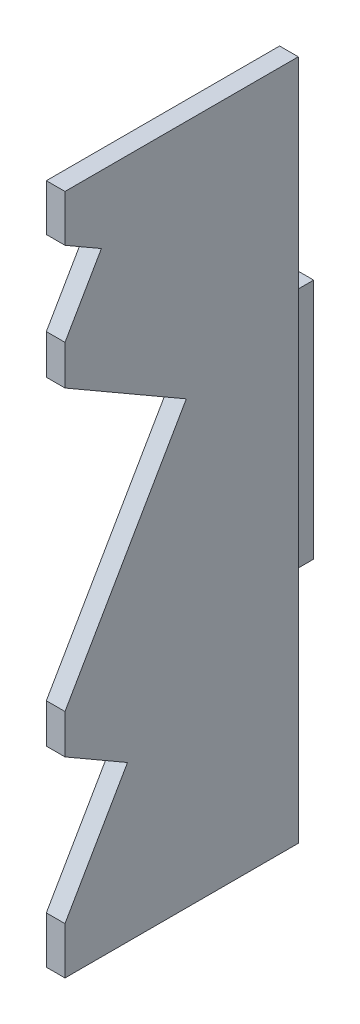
ISO-10303-21;
HEADER;
FILE_DESCRIPTION(('STEP AP214'),'2;1');
FILE_NAME('part.step','',(''),(''),'','','');
FILE_SCHEMA(('AUTOMOTIVE_DESIGN { 1 0 10303 214 1 1 1 1 }'));
ENDSEC;
DATA;
#1=APPLICATION_CONTEXT('core data for automotive mechanical design processes');
#2=APPLICATION_PROTOCOL_DEFINITION('international standard','automotive_design',2000,#1);
#3=PRODUCT_CONTEXT('',#1,'mechanical');
#4=PRODUCT('Part','Part','',(#3));
#5=PRODUCT_RELATED_PRODUCT_CATEGORY('part','',(#4));
#6=PRODUCT_DEFINITION_FORMATION('','',#4);
#7=PRODUCT_DEFINITION_CONTEXT('part definition',#1,'design');
#8=PRODUCT_DEFINITION('design','',#6,#7);
#9=PRODUCT_DEFINITION_SHAPE('','',#8);
#10=(LENGTH_UNIT() NAMED_UNIT(*) SI_UNIT(.MILLI.,.METRE.));
#11=(NAMED_UNIT(*) PLANE_ANGLE_UNIT() SI_UNIT($,.RADIAN.));
#12=(NAMED_UNIT(*) SI_UNIT($,.STERADIAN.) SOLID_ANGLE_UNIT());
#13=UNCERTAINTY_MEASURE_WITH_UNIT(LENGTH_MEASURE(1.E-05),#10,'distance_accuracy_value','');
#14=(GEOMETRIC_REPRESENTATION_CONTEXT(3) GLOBAL_UNCERTAINTY_ASSIGNED_CONTEXT((#13)) GLOBAL_UNIT_ASSIGNED_CONTEXT((#10,
#11,#12)) REPRESENTATION_CONTEXT('',''));
#15=CARTESIAN_POINT('',(0.,0.,0.));
#16=DIRECTION('',(0.,0.,1.));
#17=DIRECTION('',(1.,0.,0.));
#18=AXIS2_PLACEMENT_3D('',#15,#16,#17);
#19=CARTESIAN_POINT('',(0.,41.3691688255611,12.5285300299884));
#20=DIRECTION('',(-1.,0.,0.));
#21=DIRECTION('',(0.,1.,0.));
#22=AXIS2_PLACEMENT_3D('',#19,#20,#21);
#23=PLANE('',#22);
#24=DIRECTION('',(0.,1.,0.));
#25=VECTOR('',#24,1.);
#26=CARTESIAN_POINT('',(0.,35.,7.69999999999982));
#27=LINE('',#26,#25);
#28=CARTESIAN_POINT('',(0.,-35.,7.69999999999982));
#29=VERTEX_POINT('',#28);
#30=CARTESIAN_POINT('',(0.,35.,7.69999999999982));
#31=VERTEX_POINT('',#30);
#32=EDGE_CURVE('E174',#29,#31,#27,.T.);
#33=ORIENTED_EDGE('',*,*,#32,.F.);
#34=DIRECTION('',(0.,0.,1.));
#35=VECTOR('',#34,1.);
#36=CARTESIAN_POINT('',(0.,-35.,7.69999999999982));
#37=LINE('',#36,#35);
#38=CARTESIAN_POINT('',(0.,-34.9999999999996,0.));
#39=VERTEX_POINT('',#38);
#40=EDGE_CURVE('E189',#39,#29,#37,.T.);
#41=ORIENTED_EDGE('',*,*,#40,.F.);
#42=DIRECTION('',(0.,-1.,0.));
#43=VECTOR('',#42,1.);
#44=CARTESIAN_POINT('',(0.,73.,0.));
#45=LINE('',#44,#43);
#46=CARTESIAN_POINT('',(0.,-73.,0.));
#47=VERTEX_POINT('',#46);
#48=EDGE_CURVE('E220',#39,#47,#45,.T.);
#49=ORIENTED_EDGE('',*,*,#48,.T.);
#50=DIRECTION('',(0.,0.,1.));
#51=VECTOR('',#50,1.);
#52=CARTESIAN_POINT('',(0.,-73.,0.));
#53=LINE('',#52,#51);
#54=CARTESIAN_POINT('',(0.,-73.,50.));
#55=VERTEX_POINT('',#54);
#56=EDGE_CURVE('E223',#47,#55,#53,.T.);
#57=ORIENTED_EDGE('',*,*,#56,.T.);
#58=DIRECTION('',(0.,1.,0.));
#59=VECTOR('',#58,1.);
#60=CARTESIAN_POINT('',(0.,-73.,50.));
#61=LINE('',#60,#59);
#62=CARTESIAN_POINT('',(0.,-62.9094808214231,50.));
#63=VERTEX_POINT('',#62);
#64=EDGE_CURVE('E260',#55,#63,#61,.T.);
#65=ORIENTED_EDGE('',*,*,#64,.T.);
#66=DIRECTION('',(0.,0.866025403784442,-0.5));
#67=VECTOR('',#66,1.);
#68=CARTESIAN_POINT('',(0.,-39.6999999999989,36.6));
#69=LINE('',#68,#67);
#70=CARTESIAN_POINT('',(0.,-39.6999999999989,36.6));
#71=VERTEX_POINT('',#70);
#72=EDGE_CURVE('E261',#63,#71,#69,.T.);
#73=ORIENTED_EDGE('',*,*,#72,.T.);
#74=DIRECTION('',(0.,0.499999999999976,0.866025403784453));
#75=VECTOR('',#74,1.);
#76=CARTESIAN_POINT('',(0.,-39.6999999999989,36.6));
#77=LINE('',#76,#75);
#78=CARTESIAN_POINT('',(0.,-31.9635063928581,50.));
#79=VERTEX_POINT('',#78);
#80=EDGE_CURVE('E263',#71,#79,#77,.T.);
#81=ORIENTED_EDGE('',*,*,#80,.T.);
#82=DIRECTION('',(0.,1.,0.));
#83=VECTOR('',#82,1.);
#84=CARTESIAN_POINT('',(0.,-31.9635063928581,50.));
#85=LINE('',#84,#83);
#86=CARTESIAN_POINT('',(0.,-23.5333209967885,50.));
#87=VERTEX_POINT('',#86);
#88=EDGE_CURVE('E268',#79,#87,#85,.T.);
#89=ORIENTED_EDGE('',*,*,#88,.T.);
#90=DIRECTION('',(0.,0.866025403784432,-0.500000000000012));
#91=VECTOR('',#90,1.);
#92=CARTESIAN_POINT('',(0.,21.5000000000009,24.));
#93=LINE('',#92,#91);
#94=CARTESIAN_POINT('',(0.,21.5000000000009,24.));
#95=VERTEX_POINT('',#94);
#96=EDGE_CURVE('E271',#87,#95,#93,.T.);
#97=ORIENTED_EDGE('',*,*,#96,.T.);
#98=DIRECTION('',(0.,0.499999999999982,0.866025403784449));
#99=VECTOR('',#98,1.);
#100=CARTESIAN_POINT('',(0.,21.5000000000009,24.));
#101=LINE('',#100,#99);
#102=CARTESIAN_POINT('',(0.,36.5111069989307,50.));
#103=VERTEX_POINT('',#102);
#104=EDGE_CURVE('E274',#95,#103,#101,.T.);
#105=ORIENTED_EDGE('',*,*,#104,.T.);
#106=DIRECTION('',(0.,1.,0.));
#107=VECTOR('',#106,1.);
#108=CARTESIAN_POINT('',(0.,36.5111069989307,50.));
#109=LINE('',#108,#107);
#110=CARTESIAN_POINT('',(0.,44.990003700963,50.));
#111=VERTEX_POINT('',#110);
#112=EDGE_CURVE('E277',#103,#111,#109,.T.);
#113=ORIENTED_EDGE('',*,*,#112,.T.);
#114=DIRECTION('',(0.,0.866025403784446,-0.499999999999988));
#115=VECTOR('',#114,1.);
#116=CARTESIAN_POINT('',(0.,58.5000000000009,42.2));
#117=LINE('',#116,#115);
#118=CARTESIAN_POINT('',(0.,58.5000000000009,42.2));
#119=VERTEX_POINT('',#118);
#120=EDGE_CURVE('E280',#111,#119,#117,.T.);
#121=ORIENTED_EDGE('',*,*,#120,.T.);
#122=DIRECTION('',(0.,0.500000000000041,0.866025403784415));
#123=VECTOR('',#122,1.);
#124=CARTESIAN_POINT('',(0.,58.5000000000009,42.2));
#125=LINE('',#124,#123);
#126=CARTESIAN_POINT('',(0.,63.0033320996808,50.));
#127=VERTEX_POINT('',#126);
#128=EDGE_CURVE('E205',#119,#127,#125,.T.);
#129=ORIENTED_EDGE('',*,*,#128,.T.);
#130=DIRECTION('',(0.,1.,0.));
#131=VECTOR('',#130,1.);
#132=CARTESIAN_POINT('',(0.,63.0033320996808,50.));
#133=LINE('',#132,#131);
#134=CARTESIAN_POINT('',(0.,73.,50.));
#135=VERTEX_POINT('',#134);
#136=EDGE_CURVE('E215',#127,#135,#133,.T.);
#137=ORIENTED_EDGE('',*,*,#136,.T.);
#138=DIRECTION('',(0.,0.,-1.));
#139=VECTOR('',#138,1.);
#140=CARTESIAN_POINT('',(0.,73.,50.));
#141=LINE('',#140,#139);
#142=CARTESIAN_POINT('',(0.,73.,0.));
#143=VERTEX_POINT('',#142);
#144=EDGE_CURVE('E218',#135,#143,#141,.T.);
#145=ORIENTED_EDGE('',*,*,#144,.T.);
#146=CARTESIAN_POINT('',(0.,35.,0.));
#147=VERTEX_POINT('',#146);
#148=EDGE_CURVE('E177',#143,#147,#45,.T.);
#149=ORIENTED_EDGE('',*,*,#148,.T.);
#150=DIRECTION('',(0.,0.,-1.));
#151=VECTOR('',#150,1.);
#152=CARTESIAN_POINT('',(0.,35.,0.));
#153=LINE('',#152,#151);
#154=EDGE_CURVE('E18',#31,#147,#153,.T.);
#155=ORIENTED_EDGE('',*,*,#154,.F.);
#156=EDGE_LOOP('',(#33,#41,#49,#57,#65,#73,#81,#89,#97,#105,#113,#121,#129,#137,#145,#149,#155));
#157=FACE_BOUND('',#156,.T.);
#158=ADVANCED_FACE('F14',(#157),#23,.T.);
#159=CARTESIAN_POINT('',(4.,58.5000000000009,42.2));
#160=DIRECTION('',(0.,0.866025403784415,-0.500000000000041));
#161=DIRECTION('',(0.,-0.500000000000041,-0.866025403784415));
#162=AXIS2_PLACEMENT_3D('',#159,#160,#161);
#163=PLANE('',#162);
#164=ORIENTED_EDGE('',*,*,#128,.F.);
#165=DIRECTION('',(-1.,0.,0.));
#166=VECTOR('',#165,1.);
#167=CARTESIAN_POINT('',(4.,58.5000000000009,42.2));
#168=LINE('',#167,#166);
#169=CARTESIAN_POINT('',(4.,58.5000000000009,42.2));
#170=VERTEX_POINT('',#169);
#171=EDGE_CURVE('E317',#170,#119,#168,.T.);
#172=ORIENTED_EDGE('',*,*,#171,.F.);
#173=DIRECTION('',(0.,0.500000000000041,0.866025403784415));
#174=VECTOR('',#173,1.);
#175=CARTESIAN_POINT('',(4.,58.5000000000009,42.2));
#176=LINE('',#175,#174);
#177=CARTESIAN_POINT('',(4.,63.0033320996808,50.));
#178=VERTEX_POINT('',#177);
#179=EDGE_CURVE('E283',#170,#178,#176,.T.);
#180=ORIENTED_EDGE('',*,*,#179,.T.);
#181=DIRECTION('',(-1.,0.,0.));
#182=VECTOR('',#181,1.);
#183=CARTESIAN_POINT('',(4.,63.0033320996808,50.));
#184=LINE('',#183,#182);
#185=EDGE_CURVE('E9',#178,#127,#184,.T.);
#186=ORIENTED_EDGE('',*,*,#185,.T.);
#187=EDGE_LOOP('',(#164,#172,#180,#186));
#188=FACE_BOUND('',#187,.T.);
#189=ADVANCED_FACE('F16',(#188),#163,.F.);
#190=CARTESIAN_POINT('',(4.,63.0033320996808,50.));
#191=DIRECTION('',(0.,0.,-1.));
#192=DIRECTION('',(0.,-1.,0.));
#193=AXIS2_PLACEMENT_3D('',#190,#191,#192);
#194=PLANE('',#193);
#195=ORIENTED_EDGE('',*,*,#136,.F.);
#196=ORIENTED_EDGE('',*,*,#185,.F.);
#197=DIRECTION('',(0.,1.,0.));
#198=VECTOR('',#197,1.);
#199=CARTESIAN_POINT('',(4.,63.0033320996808,50.));
#200=LINE('',#199,#198);
#201=CARTESIAN_POINT('',(4.,73.,50.));
#202=VERTEX_POINT('',#201);
#203=EDGE_CURVE('E286',#178,#202,#200,.T.);
#204=ORIENTED_EDGE('',*,*,#203,.T.);
#205=DIRECTION('',(-1.,0.,0.));
#206=VECTOR('',#205,1.);
#207=CARTESIAN_POINT('',(4.,73.,50.));
#208=LINE('',#207,#206);
#209=EDGE_CURVE('E24',#202,#135,#208,.T.);
#210=ORIENTED_EDGE('',*,*,#209,.T.);
#211=EDGE_LOOP('',(#195,#196,#204,#210));
#212=FACE_BOUND('',#211,.T.);
#213=ADVANCED_FACE('F338',(#212),#194,.F.);
#214=CARTESIAN_POINT('',(4.,73.,50.));
#215=DIRECTION('',(0.,-1.,0.));
#216=DIRECTION('',(-1.,0.,0.));
#217=AXIS2_PLACEMENT_3D('',#214,#215,#216);
#218=PLANE('',#217);
#219=ORIENTED_EDGE('',*,*,#144,.F.);
#220=ORIENTED_EDGE('',*,*,#209,.F.);
#221=DIRECTION('',(0.,0.,-1.));
#222=VECTOR('',#221,1.);
#223=CARTESIAN_POINT('',(4.,73.,50.));
#224=LINE('',#223,#222);
#225=CARTESIAN_POINT('',(4.,73.,0.));
#226=VERTEX_POINT('',#225);
#227=EDGE_CURVE('E289',#202,#226,#224,.T.);
#228=ORIENTED_EDGE('',*,*,#227,.T.);
#229=DIRECTION('',(-1.,0.,0.));
#230=VECTOR('',#229,1.);
#231=CARTESIAN_POINT('',(4.,73.,0.));
#232=LINE('',#231,#230);
#233=EDGE_CURVE('E254',#226,#143,#232,.T.);
#234=ORIENTED_EDGE('',*,*,#233,.T.);
#235=EDGE_LOOP('',(#219,#220,#228,#234));
#236=FACE_BOUND('',#235,.T.);
#237=ADVANCED_FACE('F341',(#236),#218,.F.);
#238=CARTESIAN_POINT('',(4.,73.,0.));
#239=DIRECTION('',(0.,0.,1.));
#240=DIRECTION('',(1.,0.,0.));
#241=AXIS2_PLACEMENT_3D('',#238,#239,#240);
#242=PLANE('',#241);
#243=ORIENTED_EDGE('',*,*,#148,.F.);
#244=ORIENTED_EDGE('',*,*,#233,.F.);
#245=DIRECTION('',(0.,-1.,0.));
#246=VECTOR('',#245,1.);
#247=CARTESIAN_POINT('',(4.,73.,0.));
#248=LINE('',#247,#246);
#249=CARTESIAN_POINT('',(4.,-73.,0.));
#250=VERTEX_POINT('',#249);
#251=EDGE_CURVE('E251',#226,#250,#248,.T.);
#252=ORIENTED_EDGE('',*,*,#251,.T.);
#253=DIRECTION('',(-1.,0.,0.));
#254=VECTOR('',#253,1.);
#255=CARTESIAN_POINT('',(4.,-73.,0.));
#256=LINE('',#255,#254);
#257=EDGE_CURVE('E249',#250,#47,#256,.T.);
#258=ORIENTED_EDGE('',*,*,#257,.T.);
#259=ORIENTED_EDGE('',*,*,#48,.F.);
#260=DIRECTION('',(1.,0.,0.));
#261=VECTOR('',#260,1.);
#262=CARTESIAN_POINT('',(-6.,-34.9999999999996,0.));
#263=LINE('',#262,#261);
#264=CARTESIAN_POINT('',(-6.,-34.9999999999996,0.));
#265=VERTEX_POINT('',#264);
#266=EDGE_CURVE('E206',#265,#39,#263,.T.);
#267=ORIENTED_EDGE('',*,*,#266,.F.);
#268=DIRECTION('',(0.,-1.,0.));
#269=VECTOR('',#268,1.);
#270=CARTESIAN_POINT('',(-6.,-25.9,0.));
#271=LINE('',#270,#269);
#272=CARTESIAN_POINT('',(-6.,-25.9,0.));
#273=VERTEX_POINT('',#272);
#274=EDGE_CURVE('E200',#273,#265,#271,.T.);
#275=ORIENTED_EDGE('',*,*,#274,.F.);
#276=DIRECTION('',(1.,0.,0.));
#277=VECTOR('',#276,1.);
#278=CARTESIAN_POINT('',(-6.,-25.9,0.));
#279=LINE('',#278,#277);
#280=CARTESIAN_POINT('',(0.,-25.9,0.));
#281=VERTEX_POINT('',#280);
#282=EDGE_CURVE('E209',#273,#281,#279,.T.);
#283=ORIENTED_EDGE('',*,*,#282,.T.);
#284=CARTESIAN_POINT('',(0.,25.9,0.));
#285=VERTEX_POINT('',#284);
#286=EDGE_CURVE('E231',#285,#281,#45,.T.);
#287=ORIENTED_EDGE('',*,*,#286,.F.);
#288=DIRECTION('',(1.,0.,0.));
#289=VECTOR('',#288,1.);
#290=CARTESIAN_POINT('',(-6.,25.9,0.));
#291=LINE('',#290,#289);
#292=CARTESIAN_POINT('',(-6.,25.9,0.));
#293=VERTEX_POINT('',#292);
#294=EDGE_CURVE('E211',#293,#285,#291,.T.);
#295=ORIENTED_EDGE('',*,*,#294,.F.);
#296=DIRECTION('',(0.,-1.,0.));
#297=VECTOR('',#296,1.);
#298=CARTESIAN_POINT('',(-6.,35.,0.));
#299=LINE('',#298,#297);
#300=CARTESIAN_POINT('',(-6.,35.,0.));
#301=VERTEX_POINT('',#300);
#302=EDGE_CURVE('E191',#301,#293,#299,.T.);
#303=ORIENTED_EDGE('',*,*,#302,.F.);
#304=DIRECTION('',(1.,0.,0.));
#305=VECTOR('',#304,1.);
#306=CARTESIAN_POINT('',(-6.,35.,0.));
#307=LINE('',#306,#305);
#308=EDGE_CURVE('E168',#301,#147,#307,.T.);
#309=ORIENTED_EDGE('',*,*,#308,.T.);
#310=EDGE_LOOP('',(#243,#244,#252,#258,#259,#267,#275,#283,#287,#295,#303,#309));
#311=FACE_BOUND('',#310,.T.);
#312=ADVANCED_FACE('F245',(#311),#242,.F.);
#313=CARTESIAN_POINT('',(4.,-73.,0.));
#314=DIRECTION('',(0.,1.,0.));
#315=DIRECTION('',(1.,0.,0.));
#316=AXIS2_PLACEMENT_3D('',#313,#314,#315);
#317=PLANE('',#316);
#318=ORIENTED_EDGE('',*,*,#56,.F.);
#319=ORIENTED_EDGE('',*,*,#257,.F.);
#320=DIRECTION('',(0.,0.,1.));
#321=VECTOR('',#320,1.);
#322=CARTESIAN_POINT('',(4.,-73.,0.));
#323=LINE('',#322,#321);
#324=CARTESIAN_POINT('',(4.,-73.,50.));
#325=VERTEX_POINT('',#324);
#326=EDGE_CURVE('E293',#250,#325,#323,.T.);
#327=ORIENTED_EDGE('',*,*,#326,.T.);
#328=DIRECTION('',(-1.,0.,0.));
#329=VECTOR('',#328,1.);
#330=CARTESIAN_POINT('',(4.,-73.,50.));
#331=LINE('',#330,#329);
#332=EDGE_CURVE('E255',#325,#55,#331,.T.);
#333=ORIENTED_EDGE('',*,*,#332,.T.);
#334=EDGE_LOOP('',(#318,#319,#327,#333));
#335=FACE_BOUND('',#334,.T.);
#336=ADVANCED_FACE('F257',(#335),#317,.F.);
#337=CARTESIAN_POINT('',(4.,-73.,50.));
#338=DIRECTION('',(0.,0.,-1.));
#339=DIRECTION('',(0.,-1.,0.));
#340=AXIS2_PLACEMENT_3D('',#337,#338,#339);
#341=PLANE('',#340);
#342=ORIENTED_EDGE('',*,*,#64,.F.);
#343=ORIENTED_EDGE('',*,*,#332,.F.);
#344=DIRECTION('',(0.,1.,0.));
#345=VECTOR('',#344,1.);
#346=CARTESIAN_POINT('',(4.,-73.,50.));
#347=LINE('',#346,#345);
#348=CARTESIAN_POINT('',(4.,-62.9094808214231,50.));
#349=VERTEX_POINT('',#348);
#350=EDGE_CURVE('E295',#325,#349,#347,.T.);
#351=ORIENTED_EDGE('',*,*,#350,.T.);
#352=DIRECTION('',(-1.,0.,0.));
#353=VECTOR('',#352,1.);
#354=CARTESIAN_POINT('',(4.,-62.9094808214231,50.));
#355=LINE('',#354,#353);
#356=EDGE_CURVE('E331',#349,#63,#355,.T.);
#357=ORIENTED_EDGE('',*,*,#356,.T.);
#358=EDGE_LOOP('',(#342,#343,#351,#357));
#359=FACE_BOUND('',#358,.T.);
#360=ADVANCED_FACE('F434',(#359),#341,.F.);
#361=CARTESIAN_POINT('',(4.,-39.6999999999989,36.6));
#362=DIRECTION('',(0.,-0.5,-0.866025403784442));
#363=DIRECTION('',(0.,-0.866025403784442,0.5));
#364=AXIS2_PLACEMENT_3D('',#361,#362,#363);
#365=PLANE('',#364);
#366=ORIENTED_EDGE('',*,*,#72,.F.);
#367=ORIENTED_EDGE('',*,*,#356,.F.);
#368=DIRECTION('',(0.,0.866025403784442,-0.5));
#369=VECTOR('',#368,1.);
#370=CARTESIAN_POINT('',(4.,-39.6999999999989,36.6));
#371=LINE('',#370,#369);
#372=CARTESIAN_POINT('',(4.,-39.6999999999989,36.6));
#373=VERTEX_POINT('',#372);
#374=EDGE_CURVE('E298',#349,#373,#371,.T.);
#375=ORIENTED_EDGE('',*,*,#374,.T.);
#376=DIRECTION('',(-1.,0.,0.));
#377=VECTOR('',#376,1.);
#378=CARTESIAN_POINT('',(4.,-39.6999999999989,36.6));
#379=LINE('',#378,#377);
#380=EDGE_CURVE('E329',#373,#71,#379,.T.);
#381=ORIENTED_EDGE('',*,*,#380,.T.);
#382=EDGE_LOOP('',(#366,#367,#375,#381));
#383=FACE_BOUND('',#382,.T.);
#384=ADVANCED_FACE('F430',(#383),#365,.F.);
#385=CARTESIAN_POINT('',(4.,-39.6999999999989,36.6));
#386=DIRECTION('',(0.,0.866025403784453,-0.499999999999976));
#387=DIRECTION('',(0.,-0.499999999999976,-0.866025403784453));
#388=AXIS2_PLACEMENT_3D('',#385,#386,#387);
#389=PLANE('',#388);
#390=ORIENTED_EDGE('',*,*,#80,.F.);
#391=ORIENTED_EDGE('',*,*,#380,.F.);
#392=DIRECTION('',(0.,0.499999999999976,0.866025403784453));
#393=VECTOR('',#392,1.);
#394=CARTESIAN_POINT('',(4.,-39.6999999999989,36.6));
#395=LINE('',#394,#393);
#396=CARTESIAN_POINT('',(4.,-31.9635063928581,50.));
#397=VERTEX_POINT('',#396);
#398=EDGE_CURVE('E301',#373,#397,#395,.T.);
#399=ORIENTED_EDGE('',*,*,#398,.T.);
#400=DIRECTION('',(-1.,0.,0.));
#401=VECTOR('',#400,1.);
#402=CARTESIAN_POINT('',(4.,-31.9635063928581,50.));
#403=LINE('',#402,#401);
#404=EDGE_CURVE('E327',#397,#79,#403,.T.);
#405=ORIENTED_EDGE('',*,*,#404,.T.);
#406=EDGE_LOOP('',(#390,#391,#399,#405));
#407=FACE_BOUND('',#406,.T.);
#408=ADVANCED_FACE('F426',(#407),#389,.F.);
#409=CARTESIAN_POINT('',(4.,-31.9635063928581,50.));
#410=DIRECTION('',(0.,0.,-1.));
#411=DIRECTION('',(0.,-1.,0.));
#412=AXIS2_PLACEMENT_3D('',#409,#410,#411);
#413=PLANE('',#412);
#414=ORIENTED_EDGE('',*,*,#88,.F.);
#415=ORIENTED_EDGE('',*,*,#404,.F.);
#416=DIRECTION('',(0.,1.,0.));
#417=VECTOR('',#416,1.);
#418=CARTESIAN_POINT('',(4.,-31.9635063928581,50.));
#419=LINE('',#418,#417);
#420=CARTESIAN_POINT('',(4.,-23.5333209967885,50.));
#421=VERTEX_POINT('',#420);
#422=EDGE_CURVE('E304',#397,#421,#419,.T.);
#423=ORIENTED_EDGE('',*,*,#422,.T.);
#424=DIRECTION('',(-1.,0.,0.));
#425=VECTOR('',#424,1.);
#426=CARTESIAN_POINT('',(4.,-23.5333209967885,50.));
#427=LINE('',#426,#425);
#428=EDGE_CURVE('E325',#421,#87,#427,.T.);
#429=ORIENTED_EDGE('',*,*,#428,.T.);
#430=EDGE_LOOP('',(#414,#415,#423,#429));
#431=FACE_BOUND('',#430,.T.);
#432=ADVANCED_FACE('F422',(#431),#413,.F.);
#433=CARTESIAN_POINT('',(4.,21.5000000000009,24.));
#434=DIRECTION('',(0.,-0.500000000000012,-0.866025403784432));
#435=DIRECTION('',(0.,-0.866025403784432,0.500000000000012));
#436=AXIS2_PLACEMENT_3D('',#433,#434,#435);
#437=PLANE('',#436);
#438=ORIENTED_EDGE('',*,*,#96,.F.);
#439=ORIENTED_EDGE('',*,*,#428,.F.);
#440=DIRECTION('',(0.,0.866025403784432,-0.500000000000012));
#441=VECTOR('',#440,1.);
#442=CARTESIAN_POINT('',(4.,21.5000000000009,24.));
#443=LINE('',#442,#441);
#444=CARTESIAN_POINT('',(4.,21.5000000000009,24.));
#445=VERTEX_POINT('',#444);
#446=EDGE_CURVE('E307',#421,#445,#443,.T.);
#447=ORIENTED_EDGE('',*,*,#446,.T.);
#448=DIRECTION('',(-1.,0.,0.));
#449=VECTOR('',#448,1.);
#450=CARTESIAN_POINT('',(4.,21.5000000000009,24.));
#451=LINE('',#450,#449);
#452=EDGE_CURVE('E323',#445,#95,#451,.T.);
#453=ORIENTED_EDGE('',*,*,#452,.T.);
#454=EDGE_LOOP('',(#438,#439,#447,#453));
#455=FACE_BOUND('',#454,.T.);
#456=ADVANCED_FACE('F418',(#455),#437,.F.);
#457=CARTESIAN_POINT('',(4.,21.5000000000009,24.));
#458=DIRECTION('',(0.,0.866025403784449,-0.499999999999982));
#459=DIRECTION('',(0.,-0.499999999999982,-0.866025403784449));
#460=AXIS2_PLACEMENT_3D('',#457,#458,#459);
#461=PLANE('',#460);
#462=ORIENTED_EDGE('',*,*,#104,.F.);
#463=ORIENTED_EDGE('',*,*,#452,.F.);
#464=DIRECTION('',(0.,0.499999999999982,0.866025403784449));
#465=VECTOR('',#464,1.);
#466=CARTESIAN_POINT('',(4.,21.5000000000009,24.));
#467=LINE('',#466,#465);
#468=CARTESIAN_POINT('',(4.,36.5111069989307,50.));
#469=VERTEX_POINT('',#468);
#470=EDGE_CURVE('E310',#445,#469,#467,.T.);
#471=ORIENTED_EDGE('',*,*,#470,.T.);
#472=DIRECTION('',(-1.,0.,0.));
#473=VECTOR('',#472,1.);
#474=CARTESIAN_POINT('',(4.,36.5111069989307,50.));
#475=LINE('',#474,#473);
#476=EDGE_CURVE('E321',#469,#103,#475,.T.);
#477=ORIENTED_EDGE('',*,*,#476,.T.);
#478=EDGE_LOOP('',(#462,#463,#471,#477));
#479=FACE_BOUND('',#478,.T.);
#480=ADVANCED_FACE('F414',(#479),#461,.F.);
#481=CARTESIAN_POINT('',(4.,36.5111069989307,50.));
#482=DIRECTION('',(0.,0.,-1.));
#483=DIRECTION('',(0.,-1.,0.));
#484=AXIS2_PLACEMENT_3D('',#481,#482,#483);
#485=PLANE('',#484);
#486=ORIENTED_EDGE('',*,*,#112,.F.);
#487=ORIENTED_EDGE('',*,*,#476,.F.);
#488=DIRECTION('',(0.,1.,0.));
#489=VECTOR('',#488,1.);
#490=CARTESIAN_POINT('',(4.,36.5111069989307,50.));
#491=LINE('',#490,#489);
#492=CARTESIAN_POINT('',(4.,44.990003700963,50.));
#493=VERTEX_POINT('',#492);
#494=EDGE_CURVE('E313',#469,#493,#491,.T.);
#495=ORIENTED_EDGE('',*,*,#494,.T.);
#496=DIRECTION('',(-1.,0.,0.));
#497=VECTOR('',#496,1.);
#498=CARTESIAN_POINT('',(4.,44.990003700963,50.));
#499=LINE('',#498,#497);
#500=EDGE_CURVE('E319',#493,#111,#499,.T.);
#501=ORIENTED_EDGE('',*,*,#500,.T.);
#502=EDGE_LOOP('',(#486,#487,#495,#501));
#503=FACE_BOUND('',#502,.T.);
#504=ADVANCED_FACE('F411',(#503),#485,.F.);
#505=CARTESIAN_POINT('',(4.,58.5000000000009,42.2));
#506=DIRECTION('',(0.,-0.499999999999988,-0.866025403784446));
#507=DIRECTION('',(0.,-0.866025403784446,0.499999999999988));
#508=AXIS2_PLACEMENT_3D('',#505,#506,#507);
#509=PLANE('',#508);
#510=ORIENTED_EDGE('',*,*,#120,.F.);
#511=ORIENTED_EDGE('',*,*,#500,.F.);
#512=DIRECTION('',(0.,0.866025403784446,-0.499999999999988));
#513=VECTOR('',#512,1.);
#514=CARTESIAN_POINT('',(4.,58.5000000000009,42.2));
#515=LINE('',#514,#513);
#516=EDGE_CURVE('E40',#493,#170,#515,.T.);
#517=ORIENTED_EDGE('',*,*,#516,.T.);
#518=ORIENTED_EDGE('',*,*,#171,.T.);
#519=EDGE_LOOP('',(#510,#511,#517,#518));
#520=FACE_BOUND('',#519,.T.);
#521=ADVANCED_FACE('F408',(#520),#509,.F.);
#522=CARTESIAN_POINT('',(4.,41.3691688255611,12.5285300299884));
#523=DIRECTION('',(-1.,0.,0.));
#524=DIRECTION('',(0.,1.,0.));
#525=AXIS2_PLACEMENT_3D('',#522,#523,#524);
#526=PLANE('',#525);
#527=ORIENTED_EDGE('',*,*,#179,.F.);
#528=ORIENTED_EDGE('',*,*,#516,.F.);
#529=ORIENTED_EDGE('',*,*,#494,.F.);
#530=ORIENTED_EDGE('',*,*,#470,.F.);
#531=ORIENTED_EDGE('',*,*,#446,.F.);
#532=ORIENTED_EDGE('',*,*,#422,.F.);
#533=ORIENTED_EDGE('',*,*,#398,.F.);
#534=ORIENTED_EDGE('',*,*,#374,.F.);
#535=ORIENTED_EDGE('',*,*,#350,.F.);
#536=ORIENTED_EDGE('',*,*,#326,.F.);
#537=ORIENTED_EDGE('',*,*,#251,.F.);
#538=ORIENTED_EDGE('',*,*,#227,.F.);
#539=ORIENTED_EDGE('',*,*,#203,.F.);
#540=EDGE_LOOP('',(#527,#528,#529,#530,#531,#532,#533,#534,#535,#536,#537,#538,#539));
#541=FACE_BOUND('',#540,.T.);
#542=ADVANCED_FACE('F347',(#541),#526,.F.);
#543=CARTESIAN_POINT('',(0.,-25.9,7.69999999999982));
#544=DIRECTION('',(1.,0.,0.));
#545=DIRECTION('',(0.,-1.,0.));
#546=AXIS2_PLACEMENT_3D('',#543,#544,#545);
#547=PLANE('',#546);
#548=ORIENTED_EDGE('',*,*,#286,.T.);
#549=DIRECTION('',(0.,0.,1.));
#550=VECTOR('',#549,1.);
#551=CARTESIAN_POINT('',(0.,-25.9,-7.30000000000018));
#552=LINE('',#551,#550);
#553=CARTESIAN_POINT('',(0.,-25.9,-7.30000000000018));
#554=VERTEX_POINT('',#553);
#555=EDGE_CURVE('E186',#554,#281,#552,.T.);
#556=ORIENTED_EDGE('',*,*,#555,.F.);
#557=DIRECTION('',(0.,-1.,0.));
#558=VECTOR('',#557,1.);
#559=CARTESIAN_POINT('',(0.,25.9,-7.30000000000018));
#560=LINE('',#559,#558);
#561=CARTESIAN_POINT('',(0.,25.9,-7.30000000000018));
#562=VERTEX_POINT('',#561);
#563=EDGE_CURVE('E183',#562,#554,#560,.T.);
#564=ORIENTED_EDGE('',*,*,#563,.F.);
#565=DIRECTION('',(0.,0.,-1.));
#566=VECTOR('',#565,1.);
#567=CARTESIAN_POINT('',(0.,25.9,0.));
#568=LINE('',#567,#566);
#569=EDGE_CURVE('E178',#285,#562,#568,.T.);
#570=ORIENTED_EDGE('',*,*,#569,.F.);
#571=EDGE_LOOP('',(#548,#556,#564,#570));
#572=FACE_BOUND('',#571,.T.);
#573=ADVANCED_FACE('F381',(#572),#547,.T.);
#574=CARTESIAN_POINT('',(-6.,35.,7.69999999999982));
#575=DIRECTION('',(0.,0.,1.));
#576=DIRECTION('',(1.,0.,0.));
#577=AXIS2_PLACEMENT_3D('',#574,#575,#576);
#578=PLANE('',#577);
#579=ORIENTED_EDGE('',*,*,#32,.T.);
#580=DIRECTION('',(1.,0.,0.));
#581=VECTOR('',#580,1.);
#582=CARTESIAN_POINT('',(-6.,35.,7.69999999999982));
#583=LINE('',#582,#581);
#584=CARTESIAN_POINT('',(-6.,35.,7.69999999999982));
#585=VERTEX_POINT('',#584);
#586=EDGE_CURVE('E161',#585,#31,#583,.T.);
#587=ORIENTED_EDGE('',*,*,#586,.F.);
#588=DIRECTION('',(0.,1.,0.));
#589=VECTOR('',#588,1.);
#590=CARTESIAN_POINT('',(-6.,35.,7.69999999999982));
#591=LINE('',#590,#589);
#592=CARTESIAN_POINT('',(-6.,-35.,7.69999999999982));
#593=VERTEX_POINT('',#592);
#594=EDGE_CURVE('E187',#593,#585,#591,.T.);
#595=ORIENTED_EDGE('',*,*,#594,.F.);
#596=DIRECTION('',(1.,0.,0.));
#597=VECTOR('',#596,1.);
#598=CARTESIAN_POINT('',(-6.,-35.,7.69999999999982));
#599=LINE('',#598,#597);
#600=EDGE_CURVE('E32',#593,#29,#599,.T.);
#601=ORIENTED_EDGE('',*,*,#600,.T.);
#602=EDGE_LOOP('',(#579,#587,#595,#601));
#603=FACE_BOUND('',#602,.T.);
#604=ADVANCED_FACE('F179',(#603),#578,.T.);
#605=CARTESIAN_POINT('',(-6.,-35.,7.69999999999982));
#606=DIRECTION('',(0.,-1.,0.));
#607=DIRECTION('',(0.,0.,1.));
#608=AXIS2_PLACEMENT_3D('',#605,#606,#607);
#609=PLANE('',#608);
#610=ORIENTED_EDGE('',*,*,#40,.T.);
#611=ORIENTED_EDGE('',*,*,#600,.F.);
#612=DIRECTION('',(0.,0.,1.));
#613=VECTOR('',#612,1.);
#614=CARTESIAN_POINT('',(-6.,-35.,7.69999999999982));
#615=LINE('',#614,#613);
#616=EDGE_CURVE('E169',#265,#593,#615,.T.);
#617=ORIENTED_EDGE('',*,*,#616,.F.);
#618=ORIENTED_EDGE('',*,*,#266,.T.);
#619=EDGE_LOOP('',(#610,#611,#617,#618));
#620=FACE_BOUND('',#619,.T.);
#621=ADVANCED_FACE('F372',(#620),#609,.T.);
#622=CARTESIAN_POINT('',(-6.,-25.9,-7.30000000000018));
#623=DIRECTION('',(0.,-1.,0.));
#624=DIRECTION('',(-1.,0.,0.));
#625=AXIS2_PLACEMENT_3D('',#622,#623,#624);
#626=PLANE('',#625);
#627=ORIENTED_EDGE('',*,*,#555,.T.);
#628=ORIENTED_EDGE('',*,*,#282,.F.);
#629=DIRECTION('',(0.,0.,1.));
#630=VECTOR('',#629,1.);
#631=CARTESIAN_POINT('',(-6.,-25.9,-7.30000000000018));
#632=LINE('',#631,#630);
#633=CARTESIAN_POINT('',(-6.,-25.9,-7.30000000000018));
#634=VERTEX_POINT('',#633);
#635=EDGE_CURVE('E198',#634,#273,#632,.T.);
#636=ORIENTED_EDGE('',*,*,#635,.F.);
#637=DIRECTION('',(1.,0.,0.));
#638=VECTOR('',#637,1.);
#639=CARTESIAN_POINT('',(-6.,-25.9,-7.30000000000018));
#640=LINE('',#639,#638);
#641=EDGE_CURVE('E207',#634,#554,#640,.T.);
#642=ORIENTED_EDGE('',*,*,#641,.T.);
#643=EDGE_LOOP('',(#627,#628,#636,#642));
#644=FACE_BOUND('',#643,.T.);
#645=ADVANCED_FACE('F378',(#644),#626,.T.);
#646=CARTESIAN_POINT('',(-6.,25.9,-7.30000000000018));
#647=DIRECTION('',(0.,0.,-1.));
#648=DIRECTION('',(-1.,0.,0.));
#649=AXIS2_PLACEMENT_3D('',#646,#647,#648);
#650=PLANE('',#649);
#651=ORIENTED_EDGE('',*,*,#563,.T.);
#652=ORIENTED_EDGE('',*,*,#641,.F.);
#653=DIRECTION('',(0.,-1.,0.));
#654=VECTOR('',#653,1.);
#655=CARTESIAN_POINT('',(-6.,25.9,-7.30000000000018));
#656=LINE('',#655,#654);
#657=CARTESIAN_POINT('',(-6.,25.9,-7.30000000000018));
#658=VERTEX_POINT('',#657);
#659=EDGE_CURVE('E196',#658,#634,#656,.T.);
#660=ORIENTED_EDGE('',*,*,#659,.F.);
#661=DIRECTION('',(1.,0.,0.));
#662=VECTOR('',#661,1.);
#663=CARTESIAN_POINT('',(-6.,25.9,-7.30000000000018));
#664=LINE('',#663,#662);
#665=EDGE_CURVE('E210',#658,#562,#664,.T.);
#666=ORIENTED_EDGE('',*,*,#665,.T.);
#667=EDGE_LOOP('',(#651,#652,#660,#666));
#668=FACE_BOUND('',#667,.T.);
#669=ADVANCED_FACE('F383',(#668),#650,.T.);
#670=CARTESIAN_POINT('',(-6.,25.9,0.));
#671=DIRECTION('',(0.,1.,0.));
#672=DIRECTION('',(1.,0.,0.));
#673=AXIS2_PLACEMENT_3D('',#670,#671,#672);
#674=PLANE('',#673);
#675=ORIENTED_EDGE('',*,*,#569,.T.);
#676=ORIENTED_EDGE('',*,*,#665,.F.);
#677=DIRECTION('',(0.,0.,-1.));
#678=VECTOR('',#677,1.);
#679=CARTESIAN_POINT('',(-6.,25.9,0.));
#680=LINE('',#679,#678);
#681=EDGE_CURVE('E194',#293,#658,#680,.T.);
#682=ORIENTED_EDGE('',*,*,#681,.F.);
#683=ORIENTED_EDGE('',*,*,#294,.T.);
#684=EDGE_LOOP('',(#675,#676,#682,#683));
#685=FACE_BOUND('',#684,.T.);
#686=ADVANCED_FACE('F387',(#685),#674,.T.);
#687=CARTESIAN_POINT('',(-6.,35.,0.));
#688=DIRECTION('',(0.,1.,0.));
#689=DIRECTION('',(1.,0.,0.));
#690=AXIS2_PLACEMENT_3D('',#687,#688,#689);
#691=PLANE('',#690);
#692=ORIENTED_EDGE('',*,*,#154,.T.);
#693=ORIENTED_EDGE('',*,*,#308,.F.);
#694=DIRECTION('',(0.,0.,-1.));
#695=VECTOR('',#694,1.);
#696=CARTESIAN_POINT('',(-6.,35.,0.));
#697=LINE('',#696,#695);
#698=EDGE_CURVE('E166',#585,#301,#697,.T.);
#699=ORIENTED_EDGE('',*,*,#698,.F.);
#700=ORIENTED_EDGE('',*,*,#586,.T.);
#701=EDGE_LOOP('',(#692,#693,#699,#700));
#702=FACE_BOUND('',#701,.T.);
#703=ADVANCED_FACE('F163',(#702),#691,.T.);
#704=CARTESIAN_POINT('',(-6.,-25.9,7.69999999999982));
#705=DIRECTION('',(1.,0.,0.));
#706=DIRECTION('',(0.,-1.,0.));
#707=AXIS2_PLACEMENT_3D('',#704,#705,#706);
#708=PLANE('',#707);
#709=ORIENTED_EDGE('',*,*,#594,.T.);
#710=ORIENTED_EDGE('',*,*,#698,.T.);
#711=ORIENTED_EDGE('',*,*,#302,.T.);
#712=ORIENTED_EDGE('',*,*,#681,.T.);
#713=ORIENTED_EDGE('',*,*,#659,.T.);
#714=ORIENTED_EDGE('',*,*,#635,.T.);
#715=ORIENTED_EDGE('',*,*,#274,.T.);
#716=ORIENTED_EDGE('',*,*,#616,.T.);
#717=EDGE_LOOP('',(#709,#710,#711,#712,#713,#714,#715,#716));
#718=FACE_BOUND('',#717,.T.);
#719=ADVANCED_FACE('F374',(#718),#708,.F.);
#720=CLOSED_SHELL('',(#158,#189,#213,#237,#312,#336,#360,#384,#408,#432,#456,#480,#504,#521,
#542,#573,#604,#621,#645,#669,#686,#703,#719));
#721=MANIFOLD_SOLID_BREP('B1',#720);
#722=ADVANCED_BREP_SHAPE_REPRESENTATION('',(#18,#721),#14);
#723=SHAPE_DEFINITION_REPRESENTATION(#9,#722);
ENDSEC;
END-ISO-10303-21;
